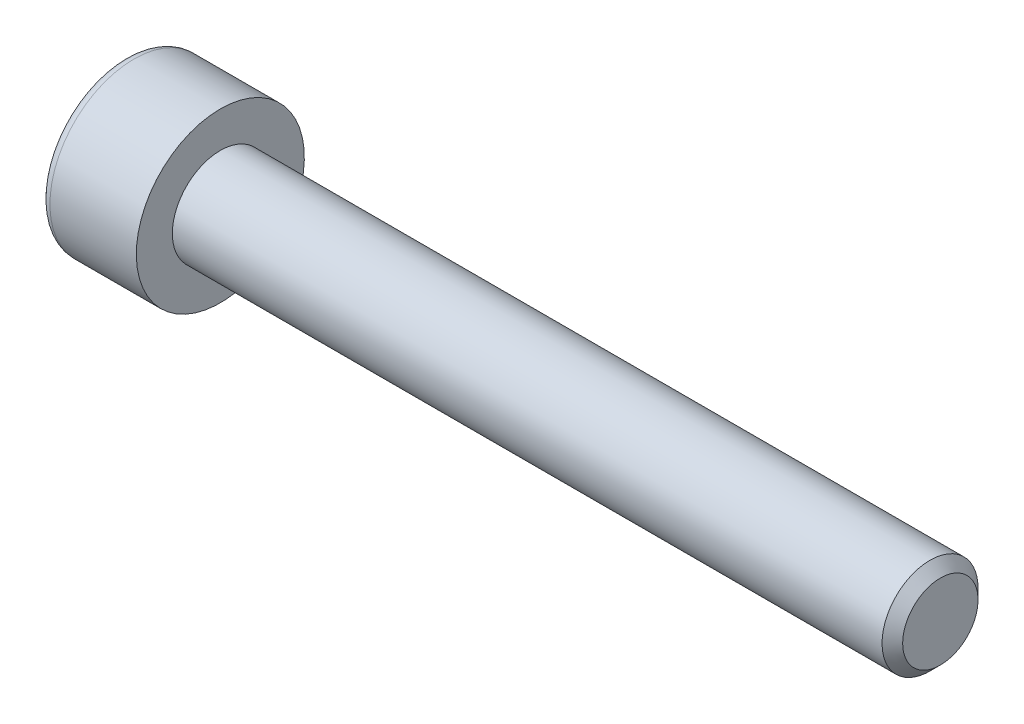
ISO-10303-21;
HEADER;
FILE_DESCRIPTION(('STEP AP214'),'2;1');
FILE_NAME('part.step','',(''),(''),'','','');
FILE_SCHEMA(('AUTOMOTIVE_DESIGN { 1 0 10303 214 1 1 1 1 }'));
ENDSEC;
DATA;
#1=APPLICATION_CONTEXT('core data for automotive mechanical design processes');
#2=APPLICATION_PROTOCOL_DEFINITION('international standard','automotive_design',2000,#1);
#3=PRODUCT_CONTEXT('',#1,'mechanical');
#4=PRODUCT('Part','Part','',(#3));
#5=PRODUCT_RELATED_PRODUCT_CATEGORY('part','',(#4));
#6=PRODUCT_DEFINITION_FORMATION('','',#4);
#7=PRODUCT_DEFINITION_CONTEXT('part definition',#1,'design');
#8=PRODUCT_DEFINITION('design','',#6,#7);
#9=PRODUCT_DEFINITION_SHAPE('','',#8);
#10=(LENGTH_UNIT() NAMED_UNIT(*) SI_UNIT(.MILLI.,.METRE.));
#11=(NAMED_UNIT(*) PLANE_ANGLE_UNIT() SI_UNIT($,.RADIAN.));
#12=(NAMED_UNIT(*) SI_UNIT($,.STERADIAN.) SOLID_ANGLE_UNIT());
#13=UNCERTAINTY_MEASURE_WITH_UNIT(LENGTH_MEASURE(1.E-05),#10,'distance_accuracy_value','');
#14=(GEOMETRIC_REPRESENTATION_CONTEXT(3) GLOBAL_UNCERTAINTY_ASSIGNED_CONTEXT((#13)) GLOBAL_UNIT_ASSIGNED_CONTEXT((#10,
#11,#12)) REPRESENTATION_CONTEXT('',''));
#15=CARTESIAN_POINT('',(0.,0.,0.));
#16=DIRECTION('',(0.,0.,1.));
#17=DIRECTION('',(1.,0.,0.));
#18=AXIS2_PLACEMENT_3D('',#15,#16,#17);
#19=CARTESIAN_POINT('',(-3.99999999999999,-1.5,0.866025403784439));
#20=DIRECTION('',(0.,-0.5,0.866025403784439));
#21=DIRECTION('',(0.,-0.866025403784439,-0.5));
#22=AXIS2_PLACEMENT_3D('',#19,#20,#21);
#23=PLANE('',#22);
#24=DIRECTION('',(1.,0.,0.));
#25=VECTOR('',#24,1.);
#26=CARTESIAN_POINT('',(-3.99999999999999,-1.5,0.866025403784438));
#27=LINE('',#26,#25);
#28=CARTESIAN_POINT('',(-1.99999998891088,-1.49999996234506,0.866025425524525));
#29=VERTEX_POINT('',#28);
#30=CARTESIAN_POINT('',(-3.99999999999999,-1.5,0.866025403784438));
#31=VERTEX_POINT('',#30);
#32=EDGE_CURVE('E79',#29,#31,#27,.F.);
#33=ORIENTED_EDGE('',*,*,#32,.T.);
#34=DIRECTION('',(0.,-0.866025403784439,-0.5));
#35=VECTOR('',#34,1.);
#36=CARTESIAN_POINT('',(-3.99999999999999,-1.5,0.866025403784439));
#37=LINE('',#36,#35);
#38=CARTESIAN_POINT('',(-3.99999999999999,0.,1.73205080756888));
#39=VERTEX_POINT('',#38);
#40=EDGE_CURVE('E91',#39,#31,#37,.T.);
#41=ORIENTED_EDGE('',*,*,#40,.F.);
#42=DIRECTION('',(1.,0.,0.));
#43=VECTOR('',#42,1.);
#44=CARTESIAN_POINT('',(-3.99999999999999,0.,1.73205080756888));
#45=LINE('',#44,#43);
#46=CARTESIAN_POINT('',(-1.99999999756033,1.17065811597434E-08,1.73205080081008));
#47=VERTEX_POINT('',#46);
#48=EDGE_CURVE('E74',#39,#47,#45,.T.);
#49=ORIENTED_EDGE('',*,*,#48,.T.);
#50=CARTESIAN_POINT('',(-2.00000000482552,-1.69656679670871E-08,1.7320507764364));
#51=CARTESIAN_POINT('',(-1.97802165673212,-0.065915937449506,1.6939942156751));
#52=CARTESIAN_POINT('',(-1.95803350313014,-0.132400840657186,1.65560914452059));
#53=CARTESIAN_POINT('',(-1.92314478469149,-0.266521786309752,1.5781743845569));
#54=CARTESIAN_POINT('',(-1.90825656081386,-0.334160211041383,1.53912332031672));
#55=CARTESIAN_POINT('',(-1.88508196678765,-0.468598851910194,1.46150513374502));
#56=CARTESIAN_POINT('',(-1.87664133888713,-0.535378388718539,1.42294995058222));
#57=CARTESIAN_POINT('',(-1.86656687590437,-0.66925151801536,1.34565826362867));
#58=CARTESIAN_POINT('',(-1.86492469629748,-0.736344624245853,1.30692204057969));
#59=CARTESIAN_POINT('',(-1.86834972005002,-0.861700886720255,1.2345475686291));
#60=CARTESIAN_POINT('',(-1.87257596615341,-0.919982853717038,1.20089845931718));
#61=CARTESIAN_POINT('',(-1.88596797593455,-1.03616709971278,1.1338194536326));
#62=CARTESIAN_POINT('',(-1.89513830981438,-1.09406897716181,1.10038978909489));
#63=CARTESIAN_POINT('',(-1.91806236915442,-1.21049257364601,1.03317259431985));
#64=CARTESIAN_POINT('',(-1.93191322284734,-1.26899956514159,0.999393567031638));
#65=CARTESIAN_POINT('',(-1.9633488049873,-1.38514116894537,0.932339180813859));
#66=CARTESIAN_POINT('',(-1.98092615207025,-1.44277726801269,0.899062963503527));
#67=CARTESIAN_POINT('',(-1.99999997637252,-1.49999992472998,0.866025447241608));
#68=B_SPLINE_CURVE_WITH_KNOTS('',3,(#50,#51,#52,#53,#54,#55,#56,#57,#58,#59,#60,#61,#62,#63,#64,
#65,#66,#67),.UNSPECIFIED.,.F.,.F.,(4,2,2,2,2,2,2,2,4),(0.,0.237762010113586,0.476095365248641,
0.708530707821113,0.940680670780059,1.14278081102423,1.34506808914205,1.55184112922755,
1.75820836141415),.UNSPECIFIED.);
#69=EDGE_CURVE('E20',#47,#29,#68,.T.);
#70=ORIENTED_EDGE('',*,*,#69,.T.);
#71=EDGE_LOOP('',(#33,#41,#49,#70));
#72=FACE_BOUND('',#71,.T.);
#73=ADVANCED_FACE('F16',(#72),#23,.F.);
#74=CARTESIAN_POINT('',(-3.99999999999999,-1.5,-0.866025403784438));
#75=DIRECTION('',(0.,-1.,0.));
#76=DIRECTION('',(0.,0.,-1.));
#77=AXIS2_PLACEMENT_3D('',#74,#75,#76);
#78=PLANE('',#77);
#79=DIRECTION('',(1.,0.,0.));
#80=VECTOR('',#79,1.);
#81=CARTESIAN_POINT('',(-3.99999999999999,-1.5,-0.866025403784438));
#82=LINE('',#81,#80);
#83=CARTESIAN_POINT('',(-1.99999998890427,-1.5,-0.866025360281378));
#84=VERTEX_POINT('',#83);
#85=CARTESIAN_POINT('',(-3.99999999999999,-1.5,-0.866025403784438));
#86=VERTEX_POINT('',#85);
#87=EDGE_CURVE('E218',#84,#86,#82,.F.);
#88=ORIENTED_EDGE('',*,*,#87,.T.);
#89=DIRECTION('',(0.,0.,-1.));
#90=VECTOR('',#89,1.);
#91=CARTESIAN_POINT('',(-3.99999999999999,-1.5,-0.866025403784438));
#92=LINE('',#91,#90);
#93=EDGE_CURVE('E90',#31,#86,#92,.T.);
#94=ORIENTED_EDGE('',*,*,#93,.F.);
#95=ORIENTED_EDGE('',*,*,#32,.F.);
#96=CARTESIAN_POINT('',(-2.00000003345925,-1.49999996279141,0.866025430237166));
#97=CARTESIAN_POINT('',(-1.97802167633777,-1.49999998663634,0.789912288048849));
#98=CARTESIAN_POINT('',(-1.95803351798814,-1.49999999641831,0.713142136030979));
#99=CARTESIAN_POINT('',(-1.92314479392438,-1.50000000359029,0.558272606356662));
#100=CARTESIAN_POINT('',(-1.90825656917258,-1.50000000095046,0.480170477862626));
#101=CARTESIAN_POINT('',(-1.88508197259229,-1.49999999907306,0.324934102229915));
#102=CARTESIAN_POINT('',(-1.87664134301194,-1.49999999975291,0.247823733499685));
#103=CARTESIAN_POINT('',(-1.86656687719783,-1.50000000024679,0.0932403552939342));
#104=CARTESIAN_POINT('',(-1.86492469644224,-1.50000000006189,0.0157679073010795));
#105=CARTESIAN_POINT('',(-1.86834971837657,-1.49999999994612,-0.128981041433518));
#106=CARTESIAN_POINT('',(-1.8725759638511,-1.49999999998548,-0.19627926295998));
#107=CARTESIAN_POINT('',(-1.88596797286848,-1.50000000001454,-0.330437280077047));
#108=CARTESIAN_POINT('',(-1.89513830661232,-1.50000000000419,-0.397296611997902));
#109=CARTESIAN_POINT('',(-1.91806236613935,-1.49999999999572,-0.531731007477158));
#110=CARTESIAN_POINT('',(-1.93191322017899,-1.49999999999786,-0.599289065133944));
#111=CARTESIAN_POINT('',(-1.96334880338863,-1.50000000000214,-0.733397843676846));
#112=CARTESIAN_POINT('',(-1.98092615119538,-1.50000000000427,-0.799950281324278));
#113=CARTESIAN_POINT('',(-1.9999999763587,-1.5,-0.866025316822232));
#114=B_SPLINE_CURVE_WITH_KNOTS('',3,(#96,#97,#98,#99,#100,#101,#102,#103,#104,#105,#106,#107,
#108,#109,#110,#111,#112,#113),.UNSPECIFIED.,.F.,.F.,(4,2,2,2,2,2,2,2,4),(0.,0.237762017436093,
0.476095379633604,0.708530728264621,0.940680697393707,1.14278084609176,1.34506813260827,
1.55184118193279,1.75820842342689),.UNSPECIFIED.);
#115=EDGE_CURVE('E84',#29,#84,#114,.T.);
#116=ORIENTED_EDGE('',*,*,#115,.T.);
#117=EDGE_LOOP('',(#88,#94,#95,#116));
#118=FACE_BOUND('',#117,.T.);
#119=ADVANCED_FACE('F88',(#118),#78,.F.);
#120=CARTESIAN_POINT('',(-3.99999999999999,0.,1.73205080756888));
#121=DIRECTION('',(0.,0.500000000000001,0.866025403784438));
#122=DIRECTION('',(0.,-0.866025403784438,0.500000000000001));
#123=AXIS2_PLACEMENT_3D('',#120,#121,#122);
#124=PLANE('',#123);
#125=ORIENTED_EDGE('',*,*,#48,.F.);
#126=DIRECTION('',(0.,-0.866025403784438,0.500000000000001));
#127=VECTOR('',#126,1.);
#128=CARTESIAN_POINT('',(-3.99999999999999,0.,1.73205080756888));
#129=LINE('',#128,#127);
#130=CARTESIAN_POINT('',(-3.99999999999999,1.5,0.866025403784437));
#131=VERTEX_POINT('',#130);
#132=EDGE_CURVE('E221',#131,#39,#129,.T.);
#133=ORIENTED_EDGE('',*,*,#132,.F.);
#134=DIRECTION('',(1.,0.,0.));
#135=VECTOR('',#134,1.);
#136=CARTESIAN_POINT('',(-3.99999999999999,1.5,0.866025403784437));
#137=LINE('',#136,#135);
#138=CARTESIAN_POINT('',(-1.99999998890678,1.5,0.866025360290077));
#139=VERTEX_POINT('',#138);
#140=EDGE_CURVE('E85',#131,#139,#137,.T.);
#141=ORIENTED_EDGE('',*,*,#140,.T.);
#142=CARTESIAN_POINT('',(-2.00000003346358,1.5000000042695,0.866025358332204));
#143=CARTESIAN_POINT('',(-1.97802167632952,1.43408410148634,0.904081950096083));
#144=CARTESIAN_POINT('',(-1.95803351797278,1.36759920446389,0.942467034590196));
#145=CARTESIAN_POINT('',(-1.92314479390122,1.23347826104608,1.01990180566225));
#146=CARTESIAN_POINT('',(-1.90825656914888,1.16583983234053,1.05895286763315));
#147=CARTESIAN_POINT('',(-1.88508197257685,1.03140118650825,1.13657105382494));
#148=CARTESIAN_POINT('',(-1.87664134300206,0.964621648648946,1.1751262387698));
#149=CARTESIAN_POINT('',(-1.86656687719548,0.830748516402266,1.25241792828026));
#150=CARTESIAN_POINT('',(-1.86492469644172,0.763655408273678,1.29115415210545));
#151=CARTESIAN_POINT('',(-1.86834971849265,0.638299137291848,1.36352862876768));
#152=CARTESIAN_POINT('',(-1.87257596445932,0.580017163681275,1.39717774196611));
#153=CARTESIAN_POINT('',(-1.8859679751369,0.463832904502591,1.46425675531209));
#154=CARTESIAN_POINT('',(-1.8951383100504,0.405931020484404,1.49768642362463));
#155=CARTESIAN_POINT('',(-1.91806237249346,0.289507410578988,1.56490362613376));
#156=CARTESIAN_POINT('',(-1.93191322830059,0.231000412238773,1.59868265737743));
#157=CARTESIAN_POINT('',(-1.96334881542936,0.114858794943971,1.66573705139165));
#158=CARTESIAN_POINT('',(-1.98092616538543,0.0572226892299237,1.69901327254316));
#159=CARTESIAN_POINT('',(-1.99999999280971,2.59584331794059E-08,1.73205079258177));
#160=B_SPLINE_CURVE_WITH_KNOTS('',3,(#142,#143,#144,#145,#146,#147,#148,#149,#150,#151,#152,
#153,#154,#155,#156,#157,#158,#159),.UNSPECIFIED.,.F.,.F.,(4,2,2,2,2,2,2,2,4),(0.,
0.237762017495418,0.476095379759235,0.708530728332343,0.940680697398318,1.14278086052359,
1.3450681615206,1.55184122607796,1.75820848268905),.UNSPECIFIED.);
#161=EDGE_CURVE('E121',#139,#47,#160,.T.);
#162=ORIENTED_EDGE('',*,*,#161,.T.);
#163=EDGE_LOOP('',(#125,#133,#141,#162));
#164=FACE_BOUND('',#163,.T.);
#165=ADVANCED_FACE('F114',(#164),#124,.F.);
#166=CARTESIAN_POINT('',(-3.99999999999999,0.,-1.73205080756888));
#167=DIRECTION('',(0.,-0.5,-0.866025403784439));
#168=DIRECTION('',(0.,0.866025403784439,-0.5));
#169=AXIS2_PLACEMENT_3D('',#166,#167,#168);
#170=PLANE('',#169);
#171=DIRECTION('',(1.,0.,0.));
#172=VECTOR('',#171,1.);
#173=CARTESIAN_POINT('',(-3.99999999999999,0.,-1.73205080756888));
#174=LINE('',#173,#172);
#175=CARTESIAN_POINT('',(-1.99999999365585,-5.19378022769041E-08,-1.73205079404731));
#176=VERTEX_POINT('',#175);
#177=CARTESIAN_POINT('',(-3.99999999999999,0.,-1.73205080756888));
#178=VERTEX_POINT('',#177);
#179=EDGE_CURVE('E126',#176,#178,#174,.F.);
#180=ORIENTED_EDGE('',*,*,#179,.T.);
#181=DIRECTION('',(0.,0.866025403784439,-0.5));
#182=VECTOR('',#181,1.);
#183=CARTESIAN_POINT('',(-3.99999999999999,0.,-1.73205080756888));
#184=LINE('',#183,#182);
#185=EDGE_CURVE('E39',#86,#178,#184,.T.);
#186=ORIENTED_EDGE('',*,*,#185,.F.);
#187=ORIENTED_EDGE('',*,*,#87,.F.);
#188=CARTESIAN_POINT('',(-2.00000003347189,-1.50000000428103,-0.866025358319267));
#189=CARTESIAN_POINT('',(-1.97802167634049,-1.43408410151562,-0.904081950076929));
#190=CARTESIAN_POINT('',(-1.95803351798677,-1.36759920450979,-0.942467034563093));
#191=CARTESIAN_POINT('',(-1.92314479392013,-1.23347826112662,-1.01990180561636));
#192=CARTESIAN_POINT('',(-1.90825656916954,-1.16583983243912,-1.0589528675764));
#193=CARTESIAN_POINT('',(-1.88508197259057,-1.0314011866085,-1.1365710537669));
#194=CARTESIAN_POINT('',(-1.87664134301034,-0.964621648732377,-1.17512623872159));
#195=CARTESIAN_POINT('',(-1.86656687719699,-0.830748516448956,-1.25241792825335));
#196=CARTESIAN_POINT('',(-1.86492469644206,-0.763655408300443,-1.29115415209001));
#197=CARTESIAN_POINT('',(-1.86834971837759,-0.63829914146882,-1.36352862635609));
#198=CARTESIAN_POINT('',(-1.87257596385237,-0.580017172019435,-1.39717773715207));
#199=CARTESIAN_POINT('',(-1.88596797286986,-0.463832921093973,-1.46425674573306));
#200=CARTESIAN_POINT('',(-1.89513830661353,-0.405931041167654,-1.49768641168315));
#201=CARTESIAN_POINT('',(-1.91806236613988,-0.289507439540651,-1.56490360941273));
#202=CARTESIAN_POINT('',(-1.93191322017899,-0.231000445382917,-1.59868263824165));
#203=CARTESIAN_POINT('',(-1.9633488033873,-0.114858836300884,-1.66573702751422));
#204=CARTESIAN_POINT('',(-1.98092615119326,-0.0572227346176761,-1.69901324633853));
#205=CARTESIAN_POINT('',(-1.99999997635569,-7.53205016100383E-08,-1.73205076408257));
#206=B_SPLINE_CURVE_WITH_KNOTS('',3,(#188,#189,#190,#191,#192,#193,#194,#195,#196,#197,#198,
#199,#200,#201,#202,#203,#204,#205),.UNSPECIFIED.,.F.,.F.,(4,2,2,2,2,2,2,2,4),(0.,
0.237762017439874,0.476095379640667,0.708530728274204,0.940680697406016,1.14278084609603,
1.34506813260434,1.55184118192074,1.75820842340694),.UNSPECIFIED.);
#207=EDGE_CURVE('E97',#84,#176,#206,.T.);
#208=ORIENTED_EDGE('',*,*,#207,.T.);
#209=EDGE_LOOP('',(#180,#186,#187,#208));
#210=FACE_BOUND('',#209,.T.);
#211=ADVANCED_FACE('F117',(#210),#170,.F.);
#212=CARTESIAN_POINT('',(-3.99999999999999,1.5,0.866025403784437));
#213=DIRECTION('',(0.,1.,0.));
#214=DIRECTION('',(0.,0.,1.));
#215=AXIS2_PLACEMENT_3D('',#212,#213,#214);
#216=PLANE('',#215);
#217=ORIENTED_EDGE('',*,*,#140,.F.);
#218=DIRECTION('',(0.,0.,1.));
#219=VECTOR('',#218,1.);
#220=CARTESIAN_POINT('',(-3.99999999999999,1.5,0.866025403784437));
#221=LINE('',#220,#219);
#222=CARTESIAN_POINT('',(-3.99999999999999,1.5,-0.866025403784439));
#223=VERTEX_POINT('',#222);
#224=EDGE_CURVE('E214',#223,#131,#221,.T.);
#225=ORIENTED_EDGE('',*,*,#224,.F.);
#226=DIRECTION('',(1.,0.,0.));
#227=VECTOR('',#226,1.);
#228=CARTESIAN_POINT('',(-3.99999999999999,1.5,-0.866025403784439));
#229=LINE('',#228,#227);
#230=CARTESIAN_POINT('',(-2.00000000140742,1.5,-0.866025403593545));
#231=VERTEX_POINT('',#230);
#232=EDGE_CURVE('E205',#223,#231,#229,.T.);
#233=ORIENTED_EDGE('',*,*,#232,.T.);
#234=CARTESIAN_POINT('',(-2.0000000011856,1.50000000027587,-0.866025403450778));
#235=CARTESIAN_POINT('',(-1.9780216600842,1.50000000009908,-0.789912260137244));
#236=CARTESIAN_POINT('',(-1.95803350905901,1.50000000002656,-0.713142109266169));
#237=CARTESIAN_POINT('',(-1.92314479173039,1.49999999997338,-0.558272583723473));
#238=CARTESIAN_POINT('',(-1.90825656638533,1.49999999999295,-0.480170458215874));
#239=CARTESIAN_POINT('',(-1.88508197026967,1.50000000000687,-0.324934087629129));
#240=CARTESIAN_POINT('',(-1.87664134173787,1.50000000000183,-0.247823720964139));
#241=CARTESIAN_POINT('',(-1.86656687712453,1.49999999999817,-0.0932403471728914));
#242=CARTESIAN_POINT('',(-1.86492469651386,1.49999999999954,-0.015767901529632));
#243=CARTESIAN_POINT('',(-1.86834971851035,1.5000000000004,0.128981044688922));
#244=CARTESIAN_POINT('',(-1.87257596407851,1.50000000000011,0.196279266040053));
#245=CARTESIAN_POINT('',(-1.88596797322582,1.49999999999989,0.330437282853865));
#246=CARTESIAN_POINT('',(-1.89513830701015,1.49999999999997,0.397296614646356));
#247=CARTESIAN_POINT('',(-1.91806236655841,1.50000000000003,0.531731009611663));
#248=CARTESIAN_POINT('',(-1.9319132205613,1.50000000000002,0.599289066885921));
#249=CARTESIAN_POINT('',(-1.96334880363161,1.49999999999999,0.733397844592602));
#250=CARTESIAN_POINT('',(-1.98092615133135,1.49999999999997,0.799950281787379));
#251=CARTESIAN_POINT('',(-1.99999997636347,1.5,0.866025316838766));
#252=B_SPLINE_CURVE_WITH_KNOTS('',3,(#234,#235,#236,#237,#238,#239,#240,#241,#242,#243,#244,
#245,#246,#247,#248,#249,#250,#251),.UNSPECIFIED.,.F.,.F.,(4,2,2,2,2,2,2,2,4),(0.,
0.23776200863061,0.476095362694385,0.708530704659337,0.940680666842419,1.1427808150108,
1.34506810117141,1.55184114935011,1.75820838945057),.UNSPECIFIED.);
#253=EDGE_CURVE('E98',#231,#139,#252,.T.);
#254=ORIENTED_EDGE('',*,*,#253,.T.);
#255=EDGE_LOOP('',(#217,#225,#233,#254));
#256=FACE_BOUND('',#255,.T.);
#257=ADVANCED_FACE('F136',(#256),#216,.F.);
#258=CARTESIAN_POINT('',(-2.00600000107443,0.,0.));
#259=DIRECTION('',(-1.,0.,0.));
#260=DIRECTION('',(0.,0.,1.));
#261=AXIS2_PLACEMENT_3D('',#258,#259,#260);
#262=CONICAL_SURFACE('',#261,1.74244311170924,1.04719754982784);
#263=CARTESIAN_POINT('',(-0.999999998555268,-2.27373675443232E-10,0.));
#264=VERTEX_POINT('',#263);
#265=VERTEX_LOOP('',#264);
#266=FACE_BOUND('',#265,.T.);
#267=ORIENTED_EDGE('',*,*,#253,.F.);
#268=CARTESIAN_POINT('',(-2.00000000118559,1.49999999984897,-0.866025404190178));
#269=CARTESIAN_POINT('',(-1.97802166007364,1.4340840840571,-0.904081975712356));
#270=CARTESIAN_POINT('',(-1.95803350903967,1.36759918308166,-0.942467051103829));
#271=CARTESIAN_POINT('',(-1.92314479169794,1.23347823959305,-1.01990181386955));
#272=CARTESIAN_POINT('',(-1.90825656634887,1.16583981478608,-1.05895287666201));
#273=CARTESIAN_POINT('',(-1.88508197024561,1.03140117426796,-1.13657106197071));
#274=CARTESIAN_POINT('',(-1.8766413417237,0.964621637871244,-1.17512624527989));
#275=CARTESIAN_POINT('',(-1.86656687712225,0.830748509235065,-1.25241793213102));
#276=CARTESIAN_POINT('',(-1.86492469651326,0.763655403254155,-1.29115415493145));
#277=CARTESIAN_POINT('',(-1.86834971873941,0.638299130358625,-1.36352863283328));
#278=CARTESIAN_POINT('',(-1.8725759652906,0.580017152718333,-1.39717774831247));
#279=CARTESIAN_POINT('',(-1.88596797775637,0.463832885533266,-1.46425676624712));
#280=CARTESIAN_POINT('',(-1.89513831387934,0.405930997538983,-1.4976864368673));
#281=CARTESIAN_POINT('',(-1.91806237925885,0.289507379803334,-1.56490364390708));
#282=CARTESIAN_POINT('',(-1.93191323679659,0.231000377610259,-1.59868267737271));
#283=CARTESIAN_POINT('',(-1.96334882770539,0.114858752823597,-1.66573707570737));
#284=CARTESIAN_POINT('',(-1.98092617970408,0.0572226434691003,-1.69901329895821));
#285=CARTESIAN_POINT('',(-2.00000000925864,-2.33883523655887E-08,-1.73205082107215));
#286=B_SPLINE_CURVE_WITH_KNOTS('',3,(#268,#269,#270,#271,#272,#273,#274,#275,#276,#277,#278,
#279,#280,#281,#282,#283,#284,#285),.UNSPECIFIED.,.F.,.F.,(4,2,2,2,2,2,2,2,4),(0.,
0.237762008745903,0.476095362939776,0.708530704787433,0.940680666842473,1.14278084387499,
1.34506815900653,1.5518412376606,1.75820850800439),.UNSPECIFIED.);
#287=EDGE_CURVE('E127',#231,#176,#286,.T.);
#288=ORIENTED_EDGE('',*,*,#287,.T.);
#289=ORIENTED_EDGE('',*,*,#207,.F.);
#290=ORIENTED_EDGE('',*,*,#115,.F.);
#291=ORIENTED_EDGE('',*,*,#69,.F.);
#292=ORIENTED_EDGE('',*,*,#161,.F.);
#293=EDGE_LOOP('',(#267,#288,#289,#290,#291,#292));
#294=FACE_BOUND('',#293,.T.);
#295=ADVANCED_FACE('F95',(#266,#294),#262,.F.);
#296=CARTESIAN_POINT('',(-3.99999999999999,1.5,-0.866025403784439));
#297=DIRECTION('',(0.,0.5,-0.866025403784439));
#298=DIRECTION('',(0.,0.866025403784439,0.5));
#299=AXIS2_PLACEMENT_3D('',#296,#297,#298);
#300=PLANE('',#299);
#301=ORIENTED_EDGE('',*,*,#232,.F.);
#302=DIRECTION('',(0.,0.866025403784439,0.5));
#303=VECTOR('',#302,1.);
#304=CARTESIAN_POINT('',(-3.99999999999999,0.,-1.73205080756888));
#305=LINE('',#304,#303);
#306=EDGE_CURVE('E216',#178,#223,#305,.T.);
#307=ORIENTED_EDGE('',*,*,#306,.F.);
#308=ORIENTED_EDGE('',*,*,#179,.F.);
#309=ORIENTED_EDGE('',*,*,#287,.F.);
#310=EDGE_LOOP('',(#301,#307,#308,#309));
#311=FACE_BOUND('',#310,.T.);
#312=ADVANCED_FACE('F145',(#311),#300,.F.);
#313=CARTESIAN_POINT('',(-3.99999999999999,2.61602540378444,0.));
#314=DIRECTION('',(-1.,0.,0.));
#315=DIRECTION('',(0.,0.,1.));
#316=AXIS2_PLACEMENT_3D('',#313,#314,#315);
#317=PLANE('',#316);
#318=ORIENTED_EDGE('',*,*,#185,.T.);
#319=ORIENTED_EDGE('',*,*,#306,.T.);
#320=ORIENTED_EDGE('',*,*,#224,.T.);
#321=ORIENTED_EDGE('',*,*,#132,.T.);
#322=ORIENTED_EDGE('',*,*,#40,.T.);
#323=ORIENTED_EDGE('',*,*,#93,.T.);
#324=EDGE_LOOP('',(#318,#319,#320,#321,#322,#323));
#325=FACE_BOUND('',#324,.T.);
#326=CARTESIAN_POINT('',(-3.99999999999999,0.,0.));
#327=DIRECTION('',(1.,0.,0.));
#328=DIRECTION('',(0.,1.,0.));
#329=AXIS2_PLACEMENT_3D('',#326,#327,#328);
#330=CIRCLE('',#329,3.1);
#331=CARTESIAN_POINT('',(-3.99999999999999,3.1,0.));
#332=VERTEX_POINT('',#331);
#333=EDGE_CURVE('E192',#332,#332,#330,.T.);
#334=ORIENTED_EDGE('',*,*,#333,.F.);
#335=EDGE_LOOP('',(#334));
#336=FACE_BOUND('',#335,.T.);
#337=ADVANCED_FACE('F179',(#325,#336),#317,.T.);
#338=CARTESIAN_POINT('',(-3.59999999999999,0.,0.));
#339=DIRECTION('',(1.,0.,0.));
#340=DIRECTION('',(0.,0.,-1.));
#341=AXIS2_PLACEMENT_3D('',#338,#339,#340);
#342=TOROIDAL_SURFACE('',#341,3.1,0.4);
#343=CARTESIAN_POINT('',(-3.59999999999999,0.,0.));
#344=DIRECTION('',(1.,0.,0.));
#345=DIRECTION('',(0.,1.,0.));
#346=AXIS2_PLACEMENT_3D('',#343,#344,#345);
#347=CIRCLE('',#346,3.5);
#348=CARTESIAN_POINT('',(-3.59999999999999,3.5,0.));
#349=VERTEX_POINT('',#348);
#350=EDGE_CURVE('E232',#349,#349,#347,.T.);
#351=ORIENTED_EDGE('',*,*,#350,.F.);
#352=EDGE_LOOP('',(#351));
#353=FACE_BOUND('',#352,.T.);
#354=ORIENTED_EDGE('',*,*,#333,.T.);
#355=EDGE_LOOP('',(#354));
#356=FACE_BOUND('',#355,.T.);
#357=ADVANCED_FACE('F173',(#353,#356),#342,.T.);
#358=CARTESIAN_POINT('',(-2.,0.,0.));
#359=DIRECTION('',(1.,0.,0.));
#360=DIRECTION('',(0.,1.,0.));
#361=AXIS2_PLACEMENT_3D('',#358,#359,#360);
#362=CYLINDRICAL_SURFACE('',#361,3.5);
#363=ORIENTED_EDGE('',*,*,#350,.T.);
#364=EDGE_LOOP('',(#363));
#365=FACE_BOUND('',#364,.T.);
#366=CARTESIAN_POINT('',(0.,0.,0.));
#367=DIRECTION('',(1.,0.,0.));
#368=DIRECTION('',(0.,1.,0.));
#369=AXIS2_PLACEMENT_3D('',#366,#367,#368);
#370=CIRCLE('',#369,3.5);
#371=CARTESIAN_POINT('',(0.,3.5,0.));
#372=VERTEX_POINT('',#371);
#373=EDGE_CURVE('E230',#372,#372,#370,.T.);
#374=ORIENTED_EDGE('',*,*,#373,.F.);
#375=EDGE_LOOP('',(#374));
#376=FACE_BOUND('',#375,.T.);
#377=ADVANCED_FACE('F169',(#365,#376),#362,.T.);
#378=CARTESIAN_POINT('',(30.,1.,0.));
#379=DIRECTION('',(1.,0.,0.));
#380=DIRECTION('',(0.,0.,-1.));
#381=AXIS2_PLACEMENT_3D('',#378,#379,#380);
#382=PLANE('',#381);
#383=CARTESIAN_POINT('',(30.0000000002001,0.,0.));
#384=DIRECTION('',(-1.,0.,0.));
#385=DIRECTION('',(0.,0.,1.));
#386=AXIS2_PLACEMENT_3D('',#383,#384,#385);
#387=CIRCLE('',#386,1.57058500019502);
#388=CARTESIAN_POINT('',(30.0000000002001,0.,1.57058500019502));
#389=VERTEX_POINT('',#388);
#390=EDGE_CURVE('E228',#389,#389,#387,.T.);
#391=ORIENTED_EDGE('',*,*,#390,.F.);
#392=EDGE_LOOP('',(#391));
#393=FACE_BOUND('',#392,.T.);
#394=ADVANCED_FACE('F165',(#393),#382,.T.);
#395=CARTESIAN_POINT('',(0.,2.75,0.));
#396=DIRECTION('',(1.,0.,0.));
#397=DIRECTION('',(0.,0.,-1.));
#398=AXIS2_PLACEMENT_3D('',#395,#396,#397);
#399=PLANE('',#398);
#400=CARTESIAN_POINT('',(0.,0.,0.));
#401=DIRECTION('',(1.,0.,0.));
#402=DIRECTION('',(0.,1.,0.));
#403=AXIS2_PLACEMENT_3D('',#400,#401,#402);
#404=CIRCLE('',#403,2.);
#405=CARTESIAN_POINT('',(0.,2.,0.));
#406=VERTEX_POINT('',#405);
#407=EDGE_CURVE('E30',#406,#406,#404,.T.);
#408=ORIENTED_EDGE('',*,*,#407,.F.);
#409=EDGE_LOOP('',(#408));
#410=FACE_BOUND('',#409,.T.);
#411=ORIENTED_EDGE('',*,*,#373,.T.);
#412=EDGE_LOOP('',(#411));
#413=FACE_BOUND('',#412,.T.);
#414=ADVANCED_FACE('F158',(#410,#413),#399,.T.);
#415=CARTESIAN_POINT('',(29.5705849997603,0.,0.));
#416=DIRECTION('',(-1.,0.,0.));
#417=DIRECTION('',(0.,0.,1.));
#418=AXIS2_PLACEMENT_3D('',#415,#416,#417);
#419=CONICAL_SURFACE('',#418,1.99999999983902,0.78539816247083);
#420=ORIENTED_EDGE('',*,*,#390,.T.);
#421=EDGE_LOOP('',(#420));
#422=FACE_BOUND('',#421,.T.);
#423=CARTESIAN_POINT('',(29.570585,0.,0.));
#424=DIRECTION('',(1.,0.,0.));
#425=DIRECTION('',(0.,1.,0.));
#426=AXIS2_PLACEMENT_3D('',#423,#424,#425);
#427=CIRCLE('',#426,2.);
#428=CARTESIAN_POINT('',(29.570585,2.,0.));
#429=VERTEX_POINT('',#428);
#430=EDGE_CURVE('E11',#429,#429,#427,.F.);
#431=ORIENTED_EDGE('',*,*,#430,.F.);
#432=EDGE_LOOP('',(#431));
#433=FACE_BOUND('',#432,.T.);
#434=ADVANCED_FACE('F151',(#422,#433),#419,.T.);
#435=CARTESIAN_POINT('',(20.,0.,0.));
#436=DIRECTION('',(1.,0.,0.));
#437=DIRECTION('',(0.,1.,0.));
#438=AXIS2_PLACEMENT_3D('',#435,#436,#437);
#439=CYLINDRICAL_SURFACE('',#438,2.);
#440=ORIENTED_EDGE('',*,*,#430,.T.);
#441=EDGE_LOOP('',(#440));
#442=FACE_BOUND('',#441,.T.);
#443=ORIENTED_EDGE('',*,*,#407,.T.);
#444=EDGE_LOOP('',(#443));
#445=FACE_BOUND('',#444,.T.);
#446=ADVANCED_FACE('F149',(#442,#445),#439,.T.);
#447=CLOSED_SHELL('',(#73,#119,#165,#211,#257,#295,#312,#337,#357,#377,#394,#414,#434,#446));
#448=MANIFOLD_SOLID_BREP('B1',#447);
#449=ADVANCED_BREP_SHAPE_REPRESENTATION('',(#18,#448),#14);
#450=SHAPE_DEFINITION_REPRESENTATION(#9,#449);
ENDSEC;
END-ISO-10303-21;
